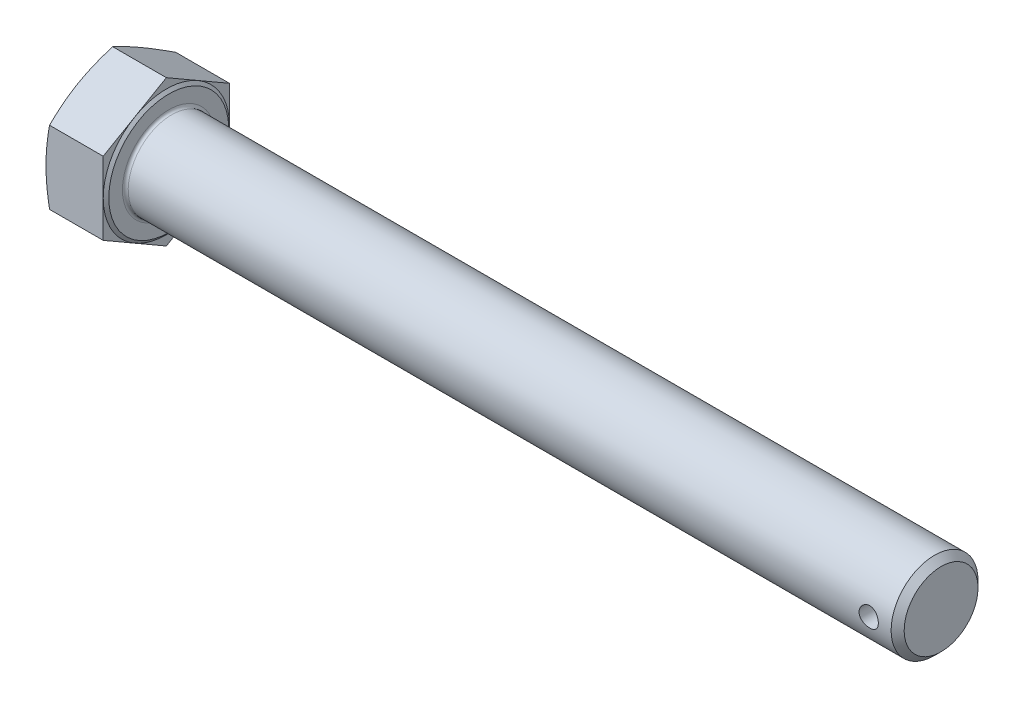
from build123d import *

# Parameters (mm, degrees)
BASEHEAD_DEPTH  = 11.85
SKETCH3_R       = 9
BASEBODY_DEPTH  = 160
CHAMFER1_SIZE   = 1.353
HEADFILLET_R    = 0.6
HOLE_DEPTH      = 174.504248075
HOLE_DEPTH_BACK = 174.504248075
SKETCH5_R       = 2


with BuildPart() as part:
    # Sketch-BaseHead → BaseHead (new body)
    with BuildSketch(Plane(origin=(0, 0, 0), x_dir=(0, 0, -1), z_dir=(1, 0, 0))):
        Polygon((0, -15.103483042), (13.08, -7.551741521), (13.08, 7.551741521), (0, 15.103483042), (-13.08, 7.551741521), (-13.08, -7.551741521), align=None)
    extrude(amount=BASEHEAD_DEPTH)

    # Sketch4 → HeadChamfer (revolve, cut)
    with BuildSketch(Plane(origin=(-0.264637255, -5.916896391, 0), x_dir=(0, 1, 0), z_dir=(0, 0, 1))):
        Polygon((21.020379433, -0.264637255), (18.996896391, -0.264637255), (21.020379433, -1.001124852), align=None)
    revolve(axis=Axis((-4.001564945, 0, 0), (1, 0, 0)), mode=Mode.SUBTRACT)

    # Sketch1 → Revolve1 (revolve)
    with BuildSketch(Plane(origin=(0, 0, 0), x_dir=(1, 0, 0), z_dir=(0, 1, 0)), mode=Mode.PRIVATE) as revolve1_sk:
        Polygon((11.85, 0), (12.35, 0), (12.35, 12.425), (11.85, 13.08), align=None)
    revolve(revolve1_sk.sketch.rotate(Axis((-4.001564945, 0, 0), (1, 0, 0)), 270), axis=Axis((-4.001564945, 0, 0), (1, 0, 0)))

    # Sketch3 → BaseBody (add)
    with BuildSketch(Plane(origin=(12.35, 0, 0), x_dir=(0, 0, -1), z_dir=(1, 0, 0))):
        with Locations(Location((0, 0, 0), (0, 0, 270))):
            Circle(SKETCH3_R)
    extrude(amount=BASEBODY_DEPTH)

    # Chamfer1
    chamfer1_edges = [part.edges().sort_by_distance(p)[0] for p in [
        (172.35, 9, 0),
    ]]
    chamfer(chamfer1_edges, length=CHAMFER1_SIZE)

    # HeadFillet
    headfillet_edges = [part.edges().sort_by_distance(p)[0] for p in [
        (12.35, 9, 0),
    ]]
    fillet(headfillet_edges, radius=HEADFILLET_R)

    # Sketch5 → Hole (cut, two sides: drawn at the far end of the back side and taken through both)
    with BuildSketch(Plane.XY.offset(-HOLE_DEPTH_BACK)):
        with Locations((166.35, 0)):
            Circle(SKETCH5_R)
    extrude(amount=HOLE_DEPTH + HOLE_DEPTH_BACK, mode=Mode.SUBTRACT)


solid = part.part
